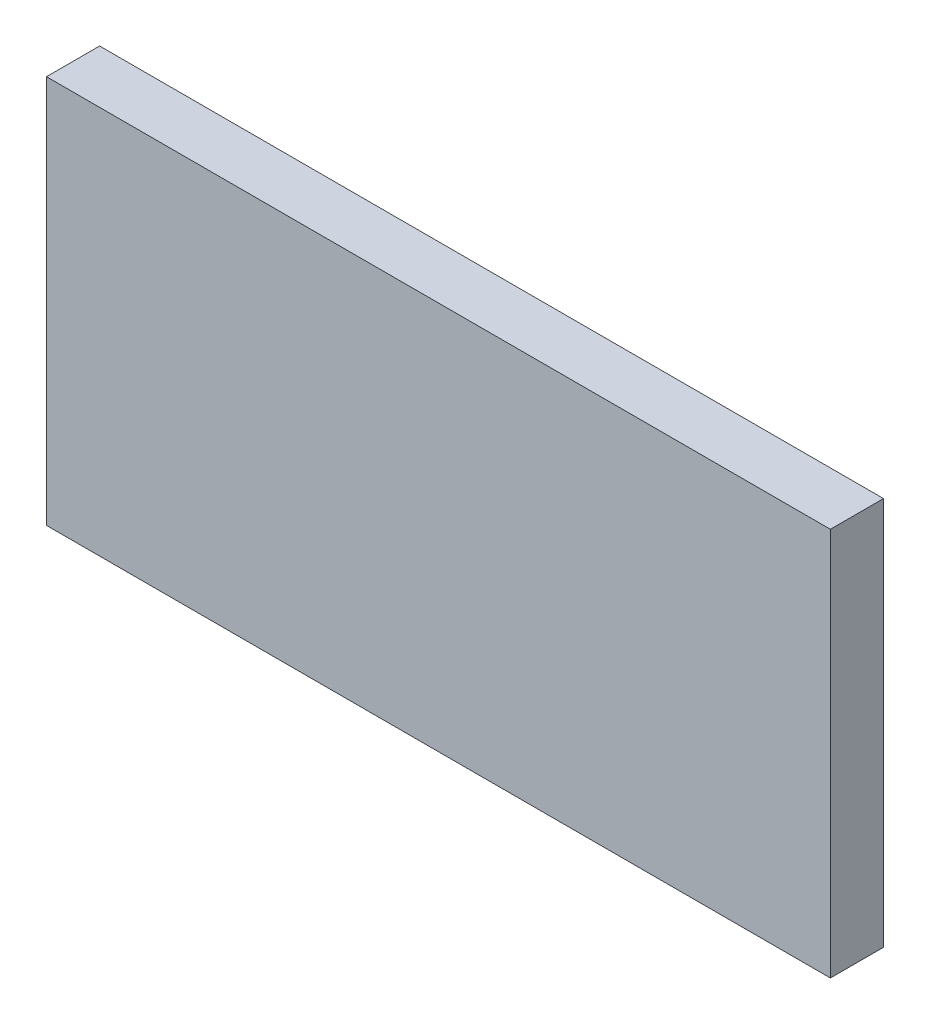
from build123d import *

# Parameters (mm, degrees)
SKETCH1_W           = 59.944
SKETCH1_H           = 29.718
BOSS_EXTRUDE1_DEPTH = 4.064


with BuildPart() as part:
    # Sketch1 → Boss-Extrude1 (new body)
    with BuildSketch(Plane.XY):
        with Locations((29.972, 14.859)):
            Rectangle(SKETCH1_W, SKETCH1_H)
    extrude(amount=BOSS_EXTRUDE1_DEPTH)


solid = part.part
